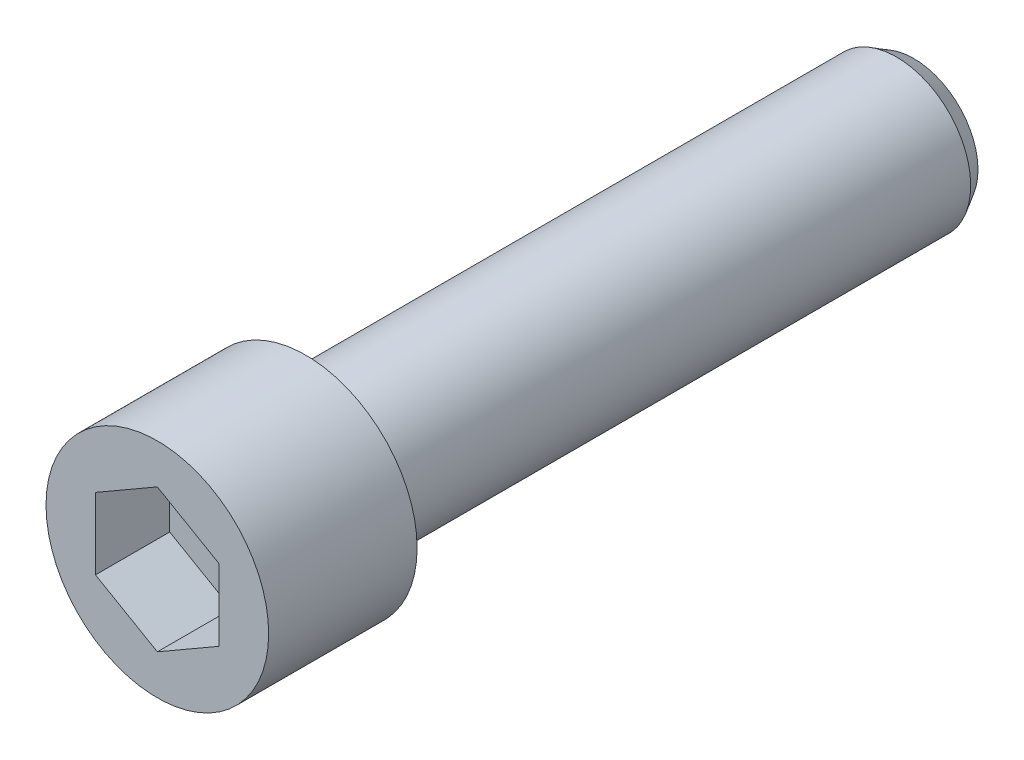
ISO-10303-21;
HEADER;
FILE_DESCRIPTION(('STEP AP214'),'2;1');
FILE_NAME('part.step','',(''),(''),'','','');
FILE_SCHEMA(('AUTOMOTIVE_DESIGN { 1 0 10303 214 1 1 1 1 }'));
ENDSEC;
DATA;
#1=APPLICATION_CONTEXT('core data for automotive mechanical design processes');
#2=APPLICATION_PROTOCOL_DEFINITION('international standard','automotive_design',2000,#1);
#3=PRODUCT_CONTEXT('',#1,'mechanical');
#4=PRODUCT('Part','Part','',(#3));
#5=PRODUCT_RELATED_PRODUCT_CATEGORY('part','',(#4));
#6=PRODUCT_DEFINITION_FORMATION('','',#4);
#7=PRODUCT_DEFINITION_CONTEXT('part definition',#1,'design');
#8=PRODUCT_DEFINITION('design','',#6,#7);
#9=PRODUCT_DEFINITION_SHAPE('','',#8);
#10=(LENGTH_UNIT() NAMED_UNIT(*) SI_UNIT(.MILLI.,.METRE.));
#11=(NAMED_UNIT(*) PLANE_ANGLE_UNIT() SI_UNIT($,.RADIAN.));
#12=(NAMED_UNIT(*) SI_UNIT($,.STERADIAN.) SOLID_ANGLE_UNIT());
#13=UNCERTAINTY_MEASURE_WITH_UNIT(LENGTH_MEASURE(1.E-05),#10,'distance_accuracy_value','');
#14=(GEOMETRIC_REPRESENTATION_CONTEXT(3) GLOBAL_UNCERTAINTY_ASSIGNED_CONTEXT((#13)) GLOBAL_UNIT_ASSIGNED_CONTEXT((#10,
#11,#12)) REPRESENTATION_CONTEXT('',''));
#15=CARTESIAN_POINT('',(0.,0.,0.));
#16=DIRECTION('',(0.,0.,1.));
#17=DIRECTION('',(1.,0.,0.));
#18=AXIS2_PLACEMENT_3D('',#15,#16,#17);
#19=CARTESIAN_POINT('',(0.,0.,2.35));
#20=DIRECTION('',(0.,0.,-1.));
#21=DIRECTION('',(1.,0.,0.));
#22=AXIS2_PLACEMENT_3D('',#19,#20,#21);
#23=SPHERICAL_SURFACE('',#22,4.35);
#24=CARTESIAN_POINT('',(0.,0.,0.85));
#25=DIRECTION('',(0.,0.,-1.));
#26=DIRECTION('',(1.,0.,0.));
#27=AXIS2_PLACEMENT_3D('',#24,#25,#26);
#28=CIRCLE('',#27,4.08319727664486);
#29=CARTESIAN_POINT('',(4.08319727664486,0.,0.85));
#30=VERTEX_POINT('',#29);
#31=EDGE_CURVE('E9',#30,#30,#28,.T.);
#32=CARTESIAN_POINT('',(0.,0.,0.));
#33=DIRECTION('',(0.,0.,-1.));
#34=DIRECTION('',(1.,0.,0.));
#35=AXIS2_PLACEMENT_3D('',#32,#33,#34);
#36=CIRCLE('',#35,3.66060104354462);
#37=CARTESIAN_POINT('',(3.66060104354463,0.,0.));
#38=VERTEX_POINT('',#37);
#39=EDGE_CURVE('E17',#38,#38,#36,.F.);
#40=CARTESIAN_POINT('',(4.08319727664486,0.,0.85));
#41=CARTESIAN_POINT('',(4.07978079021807,0.,0.840699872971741));
#42=CARTESIAN_POINT('',(4.07633252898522,0.,0.831411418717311));
#43=CARTESIAN_POINT('',(4.06937262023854,0.,0.812858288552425));
#44=CARTESIAN_POINT('',(4.06586097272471,0.,0.803593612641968));
#45=CARTESIAN_POINT('',(4.0587744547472,0.,0.785088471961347));
#46=CARTESIAN_POINT('',(4.05519958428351,0.,0.775848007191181));
#47=CARTESIAN_POINT('',(4.04798678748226,0.,0.757391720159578));
#48=CARTESIAN_POINT('',(4.04434886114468,0.,0.74817589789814));
#49=CARTESIAN_POINT('',(4.03701012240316,0.,0.729769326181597));
#50=CARTESIAN_POINT('',(4.03330930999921,0.,0.720578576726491));
#51=CARTESIAN_POINT('',(4.0258449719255,0.,0.702222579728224));
#52=CARTESIAN_POINT('',(4.02208144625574,0.,0.693057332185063));
#53=CARTESIAN_POINT('',(4.01449185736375,0.,0.674752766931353));
#54=CARTESIAN_POINT('',(4.01066579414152,0.,0.665613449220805));
#55=CARTESIAN_POINT('',(4.00295130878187,0.,0.647361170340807));
#56=CARTESIAN_POINT('',(3.99906288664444,0.,0.638248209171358));
#57=CARTESIAN_POINT('',(3.99122386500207,0.,0.620049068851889));
#58=CARTESIAN_POINT('',(3.98727326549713,0.,0.610962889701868));
#59=CARTESIAN_POINT('',(3.9793100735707,0.,0.592817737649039));
#60=CARTESIAN_POINT('',(3.97529748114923,0.,0.58375876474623));
#61=CARTESIAN_POINT('',(3.96721049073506,0.,0.565668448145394));
#62=CARTESIAN_POINT('',(3.96313609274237,0.,0.556637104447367));
#63=CARTESIAN_POINT('',(3.95492568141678,0.,0.538602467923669));
#64=CARTESIAN_POINT('',(3.95078966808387,0.,0.529599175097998));
#65=CARTESIAN_POINT('',(3.94245621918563,0.,0.51162106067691));
#66=CARTESIAN_POINT('',(3.9382587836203,0.,0.502646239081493));
#67=CARTESIAN_POINT('',(3.92980268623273,0.,0.484725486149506));
#68=CARTESIAN_POINT('',(3.9255440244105,0.,0.475779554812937));
#69=CARTESIAN_POINT('',(3.9169656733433,0.,0.457917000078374));
#70=CARTESIAN_POINT('',(3.91264598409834,0.,0.44900037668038));
#71=CARTESIAN_POINT('',(3.90394577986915,0.,0.431196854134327));
#72=CARTESIAN_POINT('',(3.89956526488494,0.,0.422309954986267));
#73=CARTESIAN_POINT('',(3.89074361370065,0.,0.404566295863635));
#74=CARTESIAN_POINT('',(3.88630247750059,0.,0.395709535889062));
#75=CARTESIAN_POINT('',(3.87735979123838,0.,0.378026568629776));
#76=CARTESIAN_POINT('',(3.87285824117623,0.,0.369200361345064));
#77=CARTESIAN_POINT('',(3.8637949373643,0.,0.351578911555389));
#78=CARTESIAN_POINT('',(3.85923318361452,0.,0.342783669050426));
#79=CARTESIAN_POINT('',(3.85004968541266,0.,0.325224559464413));
#80=CARTESIAN_POINT('',(3.84542794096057,0.,0.316460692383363));
#81=CARTESIAN_POINT('',(3.83612467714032,0.,0.298964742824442));
#82=CARTESIAN_POINT('',(3.83144315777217,0.,0.290232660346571));
#83=CARTESIAN_POINT('',(3.82202056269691,0.,0.272800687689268));
#84=CARTESIAN_POINT('',(3.8172794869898,0.,0.264100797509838));
#85=CARTESIAN_POINT('',(3.80773800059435,0.,0.246733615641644));
#86=CARTESIAN_POINT('',(3.80293758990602,0.,0.238066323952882));
#87=CARTESIAN_POINT('',(3.79327765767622,0.,0.220764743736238));
#88=CARTESIAN_POINT('',(3.78841813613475,0.,0.212130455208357));
#89=CARTESIAN_POINT('',(3.77864020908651,0.,0.194895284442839));
#90=CARTESIAN_POINT('',(3.77372180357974,0.,0.186294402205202));
#91=CARTESIAN_POINT('',(3.76382633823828,0.,0.169126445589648));
#92=CARTESIAN_POINT('',(3.75884927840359,0.,0.160559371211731));
#93=CARTESIAN_POINT('',(3.7488367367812,0.,0.143459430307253));
#94=CARTESIAN_POINT('',(3.7438012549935,0.,0.134926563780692));
#95=CARTESIAN_POINT('',(3.73367210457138,0.,0.117895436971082));
#96=CARTESIAN_POINT('',(3.72857843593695,0.,0.109397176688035));
#97=CARTESIAN_POINT('',(3.7183331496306,0.,0.0924356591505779));
#98=CARTESIAN_POINT('',(3.71318153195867,0.,0.0839724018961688));
#99=CARTESIAN_POINT('',(3.70282058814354,0.,0.0670812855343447));
#100=CARTESIAN_POINT('',(3.69761126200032,0.,0.0586534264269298));
#101=CARTESIAN_POINT('',(3.6871351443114,0.,0.0418334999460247));
#102=CARTESIAN_POINT('',(3.68186835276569,0.,0.0334414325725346));
#103=CARTESIAN_POINT('',(3.67127755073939,0.,0.0166934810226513));
#104=CARTESIAN_POINT('',(3.66595354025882,0.,0.00833759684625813));
#105=CARTESIAN_POINT('',(3.66060104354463,0.,0.));
#106=B_SPLINE_CURVE_WITH_KNOTS('',3,(#40,#41,#42,#43,#44,#45,#46,#47,#48,#49,#50,#51,#52,#53,
#54,#55,#56,#57,#58,#59,#60,#61,#62,#63,#64,#65,#66,#67,#68,#69,#70,#71,#72,#73,#74,#75,#76,#77,
#78,#79,#80,#81,#82,#83,#84,#85,#86,#87,#88,#89,#90,#91,#92,#93,#94,#95,#96,#97,#98,#99,#100,
#101,#102,#103,#104,#105),.UNSPECIFIED.,.F.,.F.,(4,2,2,2,2,2,2,2,2,2,2,2,2,2,2,2,2,2,2,2,2,2,2,
2,2,2,2,2,2,2,2,2,4),(0.,0.0297233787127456,0.0594467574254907,0.0891701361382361,
0.118893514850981,0.148616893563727,0.178340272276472,0.208063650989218,0.237787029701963,
0.267510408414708,0.297233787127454,0.326957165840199,0.356680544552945,0.38640392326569,
0.416127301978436,0.445850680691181,0.475574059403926,0.505297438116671,0.535020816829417,
0.564744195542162,0.594467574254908,0.624190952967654,0.653914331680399,0.683637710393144,
0.71336108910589,0.743084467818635,0.77280784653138,0.802531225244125,0.832254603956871,
0.861977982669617,0.891701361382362,0.921424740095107,0.951148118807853),.UNSPECIFIED.);
#107=EDGE_CURVE('BSEAM14',#30,#38,#106,.T.);
#108=ORIENTED_EDGE('',*,*,#31,.T.);
#109=ORIENTED_EDGE('',*,*,#39,.T.);
#110=ORIENTED_EDGE('',*,*,#107,.T.);
#111=ORIENTED_EDGE('',*,*,#107,.F.);
#112=EDGE_LOOP('',(#108,#110,#109,#111));
#113=FACE_BOUND('',#112,.T.);
#114=ADVANCED_FACE('F14',(#113),#23,.T.);
#115=CARTESIAN_POINT('',(5.19170962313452,0.,0.85));
#116=DIRECTION('',(0.,0.,1.));
#117=DIRECTION('',(-1.,0.,0.));
#118=AXIS2_PLACEMENT_3D('',#115,#116,#117);
#119=PLANE('',#118);
#120=ORIENTED_EDGE('',*,*,#31,.F.);
#121=EDGE_LOOP('',(#120));
#122=FACE_BOUND('',#121,.T.);
#123=CARTESIAN_POINT('',(0.,0.,0.85));
#124=DIRECTION('',(0.,0.,-1.));
#125=DIRECTION('',(1.,0.,0.));
#126=AXIS2_PLACEMENT_3D('',#123,#124,#125);
#127=CIRCLE('',#126,5.19170962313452);
#128=CARTESIAN_POINT('',(5.19170962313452,0.,0.85));
#129=VERTEX_POINT('',#128);
#130=EDGE_CURVE('E22',#129,#129,#127,.T.);
#131=ORIENTED_EDGE('',*,*,#130,.T.);
#132=EDGE_LOOP('',(#131));
#133=FACE_BOUND('',#132,.T.);
#134=ADVANCED_FACE('F137',(#122,#133),#119,.F.);
#135=CARTESIAN_POINT('',(0.,0.,2.25));
#136=DIRECTION('',(0.,0.,1.));
#137=DIRECTION('',(-1.,0.,0.));
#138=AXIS2_PLACEMENT_3D('',#135,#136,#137);
#139=CONICAL_SURFACE('',#138,6.,0.523598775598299);
#140=ORIENTED_EDGE('',*,*,#130,.F.);
#141=EDGE_LOOP('',(#140));
#142=FACE_BOUND('',#141,.T.);
#143=CARTESIAN_POINT('',(0.,0.,2.25));
#144=DIRECTION('',(0.,0.,-1.));
#145=DIRECTION('',(1.,0.,0.));
#146=AXIS2_PLACEMENT_3D('',#143,#144,#145);
#147=CIRCLE('',#146,6.);
#148=CARTESIAN_POINT('',(6.,0.,2.25));
#149=VERTEX_POINT('',#148);
#150=EDGE_CURVE('E131',#149,#149,#147,.T.);
#151=ORIENTED_EDGE('',*,*,#150,.T.);
#152=EDGE_LOOP('',(#151));
#153=FACE_BOUND('',#152,.T.);
#154=ADVANCED_FACE('F139',(#142,#153),#139,.T.);
#155=CARTESIAN_POINT('',(0.,0.,-10.));
#156=DIRECTION('',(0.,0.,-1.));
#157=DIRECTION('',(1.,0.,0.));
#158=AXIS2_PLACEMENT_3D('',#155,#156,#157);
#159=CYLINDRICAL_SURFACE('',#158,6.);
#160=CARTESIAN_POINT('',(0.,0.,50.));
#161=DIRECTION('',(0.,0.,-1.));
#162=DIRECTION('',(1.,0.,0.));
#163=AXIS2_PLACEMENT_3D('',#160,#161,#162);
#164=CIRCLE('',#163,6.);
#165=CARTESIAN_POINT('',(6.,0.,50.));
#166=VERTEX_POINT('',#165);
#167=EDGE_CURVE('E128',#166,#166,#164,.T.);
#168=ORIENTED_EDGE('',*,*,#167,.T.);
#169=EDGE_LOOP('',(#168));
#170=FACE_BOUND('',#169,.T.);
#171=ORIENTED_EDGE('',*,*,#150,.F.);
#172=EDGE_LOOP('',(#171));
#173=FACE_BOUND('',#172,.T.);
#174=ADVANCED_FACE('F142',(#170,#173),#159,.T.);
#175=CARTESIAN_POINT('',(6.,0.,50.));
#176=DIRECTION('',(0.,0.,-1.));
#177=DIRECTION('',(1.,0.,0.));
#178=AXIS2_PLACEMENT_3D('',#175,#176,#177);
#179=PLANE('',#178);
#180=CARTESIAN_POINT('',(0.,0.,50.));
#181=DIRECTION('',(0.,0.,-1.));
#182=DIRECTION('',(1.,0.,0.));
#183=AXIS2_PLACEMENT_3D('',#180,#181,#182);
#184=CIRCLE('',#183,9.);
#185=CARTESIAN_POINT('',(9.,0.,50.));
#186=VERTEX_POINT('',#185);
#187=EDGE_CURVE('E125',#186,#186,#184,.T.);
#188=ORIENTED_EDGE('',*,*,#187,.T.);
#189=EDGE_LOOP('',(#188));
#190=FACE_BOUND('',#189,.T.);
#191=ORIENTED_EDGE('',*,*,#167,.F.);
#192=EDGE_LOOP('',(#191));
#193=FACE_BOUND('',#192,.T.);
#194=ADVANCED_FACE('F147',(#190,#193),#179,.T.);
#195=CARTESIAN_POINT('',(0.,0.,-10.));
#196=DIRECTION('',(0.,0.,-1.));
#197=DIRECTION('',(1.,0.,0.));
#198=AXIS2_PLACEMENT_3D('',#195,#196,#197);
#199=CYLINDRICAL_SURFACE('',#198,9.);
#200=CARTESIAN_POINT('',(0.,0.,62.));
#201=DIRECTION('',(0.,0.,-1.));
#202=DIRECTION('',(1.,0.,0.));
#203=AXIS2_PLACEMENT_3D('',#200,#201,#202);
#204=CIRCLE('',#203,9.);
#205=CARTESIAN_POINT('',(9.,0.,62.));
#206=VERTEX_POINT('',#205);
#207=EDGE_CURVE('E122',#206,#206,#204,.T.);
#208=ORIENTED_EDGE('',*,*,#207,.T.);
#209=EDGE_LOOP('',(#208));
#210=FACE_BOUND('',#209,.T.);
#211=ORIENTED_EDGE('',*,*,#187,.F.);
#212=EDGE_LOOP('',(#211));
#213=FACE_BOUND('',#212,.T.);
#214=ADVANCED_FACE('F154',(#210,#213),#199,.T.);
#215=CARTESIAN_POINT('',(9.,0.,62.));
#216=DIRECTION('',(0.,0.,1.));
#217=DIRECTION('',(-1.,0.,0.));
#218=AXIS2_PLACEMENT_3D('',#215,#216,#217);
#219=PLANE('',#218);
#220=DIRECTION('',(-0.86602540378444,0.5,0.));
#221=VECTOR('',#220,1.);
#222=CARTESIAN_POINT('',(5.,2.88675134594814,62.));
#223=LINE('',#222,#221);
#224=CARTESIAN_POINT('',(5.,2.88675134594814,62.));
#225=VERTEX_POINT('',#224);
#226=CARTESIAN_POINT('',(0.,5.77350269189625,62.));
#227=VERTEX_POINT('',#226);
#228=EDGE_CURVE('E29',#225,#227,#223,.T.);
#229=ORIENTED_EDGE('',*,*,#228,.F.);
#230=DIRECTION('',(0.,1.,0.));
#231=VECTOR('',#230,1.);
#232=CARTESIAN_POINT('',(5.,-2.88675134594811,62.));
#233=LINE('',#232,#231);
#234=CARTESIAN_POINT('',(5.,-2.88675134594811,62.));
#235=VERTEX_POINT('',#234);
#236=EDGE_CURVE('E98',#235,#225,#233,.T.);
#237=ORIENTED_EDGE('',*,*,#236,.F.);
#238=DIRECTION('',(-0.866025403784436,-0.5,0.));
#239=VECTOR('',#238,1.);
#240=CARTESIAN_POINT('',(5.,-2.88675134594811,62.));
#241=LINE('',#240,#239);
#242=CARTESIAN_POINT('',(0.,-5.77350269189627,62.));
#243=VERTEX_POINT('',#242);
#244=EDGE_CURVE('E93',#235,#243,#241,.T.);
#245=ORIENTED_EDGE('',*,*,#244,.T.);
#246=DIRECTION('',(0.866025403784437,-0.5,0.));
#247=VECTOR('',#246,1.);
#248=CARTESIAN_POINT('',(-5.,-2.88675134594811,62.));
#249=LINE('',#248,#247);
#250=CARTESIAN_POINT('',(-5.,-2.88675134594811,62.));
#251=VERTEX_POINT('',#250);
#252=EDGE_CURVE('E91',#251,#243,#249,.T.);
#253=ORIENTED_EDGE('',*,*,#252,.F.);
#254=DIRECTION('',(0.,1.,0.));
#255=VECTOR('',#254,1.);
#256=CARTESIAN_POINT('',(-5.,-2.88675134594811,62.));
#257=LINE('',#256,#255);
#258=CARTESIAN_POINT('',(-5.,2.88675134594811,62.));
#259=VERTEX_POINT('',#258);
#260=EDGE_CURVE('E72',#251,#259,#257,.T.);
#261=ORIENTED_EDGE('',*,*,#260,.T.);
#262=DIRECTION('',(0.866025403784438,0.5,0.));
#263=VECTOR('',#262,1.);
#264=CARTESIAN_POINT('',(-5.,2.88675134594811,62.));
#265=LINE('',#264,#263);
#266=EDGE_CURVE('E83',#259,#227,#265,.T.);
#267=ORIENTED_EDGE('',*,*,#266,.T.);
#268=EDGE_LOOP('',(#229,#237,#245,#253,#261,#267));
#269=FACE_BOUND('',#268,.T.);
#270=ORIENTED_EDGE('',*,*,#207,.F.);
#271=EDGE_LOOP('',(#270));
#272=FACE_BOUND('',#271,.T.);
#273=ADVANCED_FACE('F87',(#269,#272),#219,.T.);
#274=CARTESIAN_POINT('',(5.,2.88675134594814,56.));
#275=DIRECTION('',(0.5,0.86602540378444,0.));
#276=DIRECTION('',(0.86602540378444,-0.5,0.));
#277=AXIS2_PLACEMENT_3D('',#274,#275,#276);
#278=PLANE('',#277);
#279=DIRECTION('',(0.,0.,1.));
#280=VECTOR('',#279,1.);
#281=CARTESIAN_POINT('',(5.,2.88675134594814,56.));
#282=LINE('',#281,#280);
#283=CARTESIAN_POINT('',(5.,2.88675134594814,56.));
#284=VERTEX_POINT('',#283);
#285=EDGE_CURVE('E36',#284,#225,#282,.T.);
#286=ORIENTED_EDGE('',*,*,#285,.T.);
#287=ORIENTED_EDGE('',*,*,#228,.T.);
#288=DIRECTION('',(0.,0.,1.));
#289=VECTOR('',#288,1.);
#290=CARTESIAN_POINT('',(0.,5.77350269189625,56.));
#291=LINE('',#290,#289);
#292=CARTESIAN_POINT('',(0.,5.77350269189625,56.));
#293=VERTEX_POINT('',#292);
#294=EDGE_CURVE('E80',#293,#227,#291,.T.);
#295=ORIENTED_EDGE('',*,*,#294,.F.);
#296=DIRECTION('',(-0.86602540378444,0.5,0.));
#297=VECTOR('',#296,1.);
#298=CARTESIAN_POINT('',(5.,2.88675134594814,56.));
#299=LINE('',#298,#297);
#300=EDGE_CURVE('E100',#284,#293,#299,.T.);
#301=ORIENTED_EDGE('',*,*,#300,.F.);
#302=EDGE_LOOP('',(#286,#287,#295,#301));
#303=FACE_BOUND('',#302,.T.);
#304=ADVANCED_FACE('F185',(#303),#278,.F.);
#305=CARTESIAN_POINT('',(5.,-2.88675134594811,56.));
#306=DIRECTION('',(1.,0.,0.));
#307=DIRECTION('',(0.,-1.,0.));
#308=AXIS2_PLACEMENT_3D('',#305,#306,#307);
#309=PLANE('',#308);
#310=DIRECTION('',(0.,0.,1.));
#311=VECTOR('',#310,1.);
#312=CARTESIAN_POINT('',(5.,-2.88675134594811,56.));
#313=LINE('',#312,#311);
#314=CARTESIAN_POINT('',(5.,-2.88675134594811,56.));
#315=VERTEX_POINT('',#314);
#316=EDGE_CURVE('E119',#315,#235,#313,.T.);
#317=ORIENTED_EDGE('',*,*,#316,.T.);
#318=ORIENTED_EDGE('',*,*,#236,.T.);
#319=ORIENTED_EDGE('',*,*,#285,.F.);
#320=DIRECTION('',(0.,1.,0.));
#321=VECTOR('',#320,1.);
#322=CARTESIAN_POINT('',(5.,-2.88675134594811,56.));
#323=LINE('',#322,#321);
#324=EDGE_CURVE('E112',#315,#284,#323,.T.);
#325=ORIENTED_EDGE('',*,*,#324,.F.);
#326=EDGE_LOOP('',(#317,#318,#319,#325));
#327=FACE_BOUND('',#326,.T.);
#328=ADVANCED_FACE('F193',(#327),#309,.F.);
#329=CARTESIAN_POINT('',(5.,-2.88675134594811,56.));
#330=DIRECTION('',(-0.5,0.866025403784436,0.));
#331=DIRECTION('',(0.866025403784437,0.5,0.));
#332=AXIS2_PLACEMENT_3D('',#329,#330,#331);
#333=PLANE('',#332);
#334=DIRECTION('',(0.,0.,1.));
#335=VECTOR('',#334,1.);
#336=CARTESIAN_POINT('',(0.,-5.77350269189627,56.));
#337=LINE('',#336,#335);
#338=CARTESIAN_POINT('',(0.,-5.77350269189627,56.));
#339=VERTEX_POINT('',#338);
#340=EDGE_CURVE('E117',#339,#243,#337,.T.);
#341=ORIENTED_EDGE('',*,*,#340,.T.);
#342=ORIENTED_EDGE('',*,*,#244,.F.);
#343=ORIENTED_EDGE('',*,*,#316,.F.);
#344=DIRECTION('',(-0.866025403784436,-0.5,0.));
#345=VECTOR('',#344,1.);
#346=CARTESIAN_POINT('',(5.,-2.88675134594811,56.));
#347=LINE('',#346,#345);
#348=EDGE_CURVE('E109',#315,#339,#347,.T.);
#349=ORIENTED_EDGE('',*,*,#348,.T.);
#350=EDGE_LOOP('',(#341,#342,#343,#349));
#351=FACE_BOUND('',#350,.T.);
#352=ADVANCED_FACE('F189',(#351),#333,.T.);
#353=CARTESIAN_POINT('',(-5.,-2.88675134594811,56.));
#354=DIRECTION('',(-0.5,-0.866025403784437,0.));
#355=DIRECTION('',(-0.866025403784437,0.5,0.));
#356=AXIS2_PLACEMENT_3D('',#353,#354,#355);
#357=PLANE('',#356);
#358=DIRECTION('',(0.,0.,1.));
#359=VECTOR('',#358,1.);
#360=CARTESIAN_POINT('',(-5.,-2.88675134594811,56.));
#361=LINE('',#360,#359);
#362=CARTESIAN_POINT('',(-5.,-2.88675134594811,56.));
#363=VERTEX_POINT('',#362);
#364=EDGE_CURVE('E79',#363,#251,#361,.T.);
#365=ORIENTED_EDGE('',*,*,#364,.T.);
#366=ORIENTED_EDGE('',*,*,#252,.T.);
#367=ORIENTED_EDGE('',*,*,#340,.F.);
#368=DIRECTION('',(0.866025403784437,-0.5,0.));
#369=VECTOR('',#368,1.);
#370=CARTESIAN_POINT('',(-5.,-2.88675134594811,56.));
#371=LINE('',#370,#369);
#372=EDGE_CURVE('E106',#363,#339,#371,.T.);
#373=ORIENTED_EDGE('',*,*,#372,.F.);
#374=EDGE_LOOP('',(#365,#366,#367,#373));
#375=FACE_BOUND('',#374,.T.);
#376=ADVANCED_FACE('F182',(#375),#357,.F.);
#377=CARTESIAN_POINT('',(-5.,-2.88675134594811,56.));
#378=DIRECTION('',(1.,0.,0.));
#379=DIRECTION('',(0.,-1.,0.));
#380=AXIS2_PLACEMENT_3D('',#377,#378,#379);
#381=PLANE('',#380);
#382=DIRECTION('',(0.,0.,1.));
#383=VECTOR('',#382,1.);
#384=CARTESIAN_POINT('',(-5.,2.88675134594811,56.));
#385=LINE('',#384,#383);
#386=CARTESIAN_POINT('',(-5.,2.88675134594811,56.));
#387=VERTEX_POINT('',#386);
#388=EDGE_CURVE('E68',#387,#259,#385,.T.);
#389=ORIENTED_EDGE('',*,*,#388,.T.);
#390=ORIENTED_EDGE('',*,*,#260,.F.);
#391=ORIENTED_EDGE('',*,*,#364,.F.);
#392=DIRECTION('',(0.,1.,0.));
#393=VECTOR('',#392,1.);
#394=CARTESIAN_POINT('',(-5.,-2.88675134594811,56.));
#395=LINE('',#394,#393);
#396=EDGE_CURVE('E75',#363,#387,#395,.T.);
#397=ORIENTED_EDGE('',*,*,#396,.T.);
#398=EDGE_LOOP('',(#389,#390,#391,#397));
#399=FACE_BOUND('',#398,.T.);
#400=ADVANCED_FACE('F70',(#399),#381,.T.);
#401=CARTESIAN_POINT('',(-5.,2.88675134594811,56.));
#402=DIRECTION('',(0.5,-0.866025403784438,0.));
#403=DIRECTION('',(-0.866025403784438,-0.5,0.));
#404=AXIS2_PLACEMENT_3D('',#401,#402,#403);
#405=PLANE('',#404);
#406=DIRECTION('',(0.866025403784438,0.5,0.));
#407=VECTOR('',#406,1.);
#408=CARTESIAN_POINT('',(-5.,2.88675134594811,56.));
#409=LINE('',#408,#407);
#410=EDGE_CURVE('E103',#387,#293,#409,.T.);
#411=ORIENTED_EDGE('',*,*,#410,.T.);
#412=ORIENTED_EDGE('',*,*,#294,.T.);
#413=ORIENTED_EDGE('',*,*,#266,.F.);
#414=ORIENTED_EDGE('',*,*,#388,.F.);
#415=EDGE_LOOP('',(#411,#412,#413,#414));
#416=FACE_BOUND('',#415,.T.);
#417=ADVANCED_FACE('F84',(#416),#405,.T.);
#418=CARTESIAN_POINT('',(-5.,8.66025403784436,56.));
#419=DIRECTION('',(0.,0.,-1.));
#420=DIRECTION('',(1.,0.,0.));
#421=AXIS2_PLACEMENT_3D('',#418,#419,#420);
#422=PLANE('',#421);
#423=ORIENTED_EDGE('',*,*,#300,.T.);
#424=ORIENTED_EDGE('',*,*,#410,.F.);
#425=ORIENTED_EDGE('',*,*,#396,.F.);
#426=ORIENTED_EDGE('',*,*,#372,.T.);
#427=ORIENTED_EDGE('',*,*,#348,.F.);
#428=ORIENTED_EDGE('',*,*,#324,.T.);
#429=EDGE_LOOP('',(#423,#424,#425,#426,#427,#428));
#430=FACE_BOUND('',#429,.T.);
#431=ADVANCED_FACE('F170',(#430),#422,.F.);
#432=CARTESIAN_POINT('',(0.,0.,0.));
#433=DIRECTION('',(0.,0.,-1.));
#434=DIRECTION('',(1.,0.,0.));
#435=AXIS2_PLACEMENT_3D('',#432,#433,#434);
#436=PLANE('',#435);
#437=ORIENTED_EDGE('',*,*,#39,.F.);
#438=EDGE_LOOP('',(#437));
#439=FACE_BOUND('',#438,.T.);
#440=ADVANCED_FACE('F168',(#439),#436,.T.);
#441=CLOSED_SHELL('',(#114,#134,#154,#174,#194,#214,#273,#304,#328,#352,#376,#400,#417,#431,#440));
#442=MANIFOLD_SOLID_BREP('B1',#441);
#443=ADVANCED_BREP_SHAPE_REPRESENTATION('',(#18,#442),#14);
#444=SHAPE_DEFINITION_REPRESENTATION(#9,#443);
ENDSEC;
END-ISO-10303-21;
